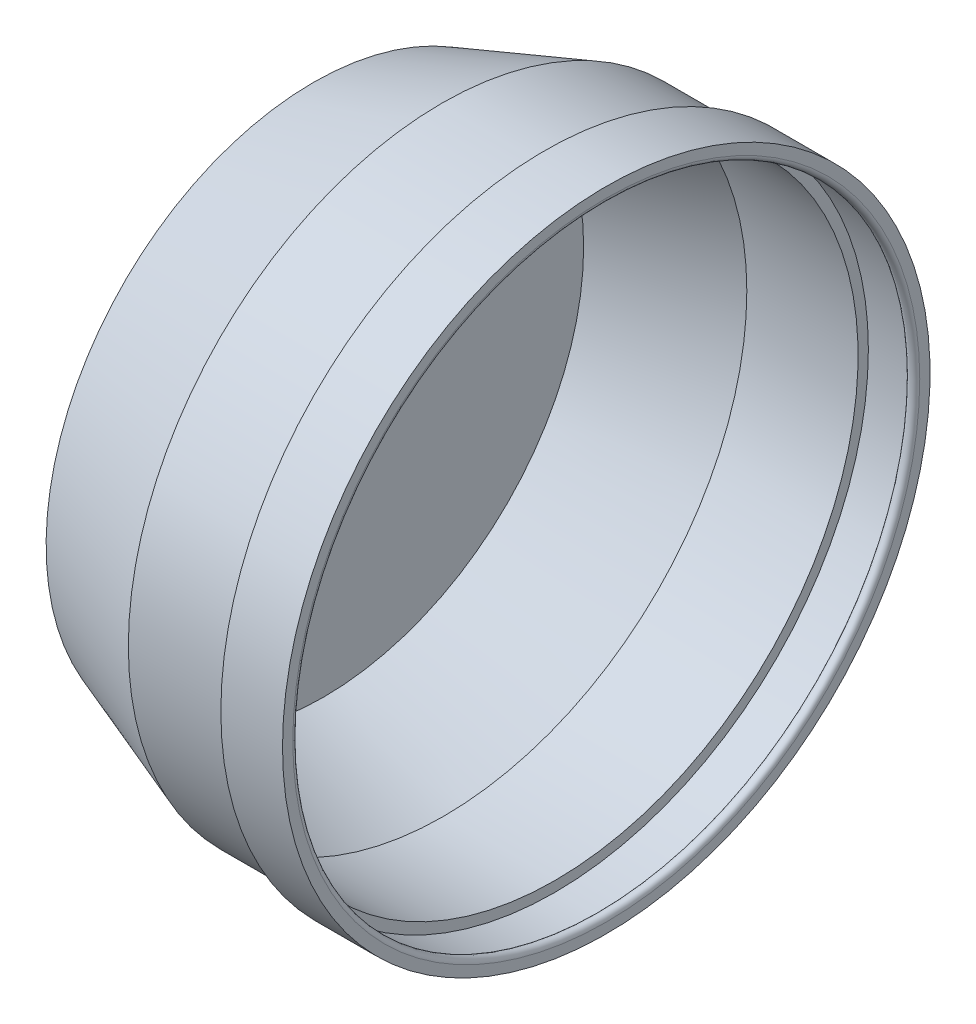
ISO-10303-21;
HEADER;
FILE_DESCRIPTION(('STEP AP214'),'2;1');
FILE_NAME('part.step','',(''),(''),'','','');
FILE_SCHEMA(('AUTOMOTIVE_DESIGN { 1 0 10303 214 1 1 1 1 }'));
ENDSEC;
DATA;
#1=APPLICATION_CONTEXT('core data for automotive mechanical design processes');
#2=APPLICATION_PROTOCOL_DEFINITION('international standard','automotive_design',2000,#1);
#3=PRODUCT_CONTEXT('',#1,'mechanical');
#4=PRODUCT('Part','Part','',(#3));
#5=PRODUCT_RELATED_PRODUCT_CATEGORY('part','',(#4));
#6=PRODUCT_DEFINITION_FORMATION('','',#4);
#7=PRODUCT_DEFINITION_CONTEXT('part definition',#1,'design');
#8=PRODUCT_DEFINITION('design','',#6,#7);
#9=PRODUCT_DEFINITION_SHAPE('','',#8);
#10=(LENGTH_UNIT() NAMED_UNIT(*) SI_UNIT(.MILLI.,.METRE.));
#11=(NAMED_UNIT(*) PLANE_ANGLE_UNIT() SI_UNIT($,.RADIAN.));
#12=(NAMED_UNIT(*) SI_UNIT($,.STERADIAN.) SOLID_ANGLE_UNIT());
#13=UNCERTAINTY_MEASURE_WITH_UNIT(LENGTH_MEASURE(1.E-05),#10,'distance_accuracy_value','');
#14=(GEOMETRIC_REPRESENTATION_CONTEXT(3) GLOBAL_UNCERTAINTY_ASSIGNED_CONTEXT((#13)) GLOBAL_UNIT_ASSIGNED_CONTEXT((#10,
#11,#12)) REPRESENTATION_CONTEXT('',''));
#15=CARTESIAN_POINT('',(0.,0.,0.));
#16=DIRECTION('',(0.,0.,1.));
#17=DIRECTION('',(1.,0.,0.));
#18=AXIS2_PLACEMENT_3D('',#15,#16,#17);
#19=CARTESIAN_POINT('',(-57.,0.,0.));
#20=DIRECTION('',(-1.,0.,0.));
#21=DIRECTION('',(0.,0.,1.));
#22=AXIS2_PLACEMENT_3D('',#19,#20,#21);
#23=PLANE('',#22);
#24=CARTESIAN_POINT('',(-57.0000000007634,0.,0.));
#25=DIRECTION('',(1.,0.,0.));
#26=DIRECTION('',(0.,1.,0.));
#27=AXIS2_PLACEMENT_3D('',#24,#25,#26);
#28=CIRCLE('',#27,52.0000000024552);
#29=CARTESIAN_POINT('',(-57.0000000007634,52.0000000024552,0.));
#30=VERTEX_POINT('',#29);
#31=EDGE_CURVE('E53',#30,#30,#28,.F.);
#32=ORIENTED_EDGE('',*,*,#31,.T.);
#33=EDGE_LOOP('',(#32));
#34=FACE_BOUND('',#33,.T.);
#35=ADVANCED_FACE('F30',(#34),#23,.T.);
#36=CARTESIAN_POINT('',(-57.,0.,0.));
#37=DIRECTION('',(1.,0.,0.));
#38=DIRECTION('',(0.,1.,0.));
#39=AXIS2_PLACEMENT_3D('',#36,#37,#38);
#40=CONICAL_SURFACE('',#39,52.00000000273,0.345555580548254);
#41=ORIENTED_EDGE('',*,*,#31,.F.);
#42=EDGE_LOOP('',(#41));
#43=FACE_BOUND('',#42,.T.);
#44=CARTESIAN_POINT('',(-32.,0.,0.));
#45=DIRECTION('',(-1.,0.,0.));
#46=DIRECTION('',(0.,0.47942553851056,0.87758256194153));
#47=AXIS2_PLACEMENT_3D('',#44,#45,#46);
#48=CIRCLE('',#47,61.0000000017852);
#49=CARTESIAN_POINT('',(-32.,29.24495785,53.53253628));
#50=VERTEX_POINT('',#49);
#51=EDGE_CURVE('E50',#50,#50,#48,.T.);
#52=ORIENTED_EDGE('',*,*,#51,.T.);
#53=EDGE_LOOP('',(#52));
#54=FACE_BOUND('',#53,.T.);
#55=ADVANCED_FACE('F96',(#43,#54),#40,.T.);
#56=CARTESIAN_POINT('',(-12.,0.,0.));
#57=DIRECTION('',(-1.,0.,0.));
#58=DIRECTION('',(0.,0.,1.));
#59=AXIS2_PLACEMENT_3D('',#56,#57,#58);
#60=CYLINDRICAL_SURFACE('',#59,61.0000000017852);
#61=ORIENTED_EDGE('',*,*,#51,.F.);
#62=EDGE_LOOP('',(#61));
#63=FACE_BOUND('',#62,.T.);
#64=CARTESIAN_POINT('',(-12.,0.,0.));
#65=DIRECTION('',(-1.,0.,0.));
#66=DIRECTION('',(0.,0.,1.));
#67=AXIS2_PLACEMENT_3D('',#64,#65,#66);
#68=CIRCLE('',#67,61.0000000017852);
#69=CARTESIAN_POINT('',(-12.,0.,61.0000000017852));
#70=VERTEX_POINT('',#69);
#71=EDGE_CURVE('E52',#70,#70,#68,.T.);
#72=ORIENTED_EDGE('',*,*,#71,.T.);
#73=EDGE_LOOP('',(#72));
#74=FACE_BOUND('',#73,.T.);
#75=ADVANCED_FACE('F89',(#63,#74),#60,.T.);
#76=CARTESIAN_POINT('',(-12.,0.,0.));
#77=DIRECTION('',(-1.,0.,0.));
#78=DIRECTION('',(0.,0.,1.));
#79=AXIS2_PLACEMENT_3D('',#76,#77,#78);
#80=PLANE('',#79);
#81=ORIENTED_EDGE('',*,*,#71,.F.);
#82=EDGE_LOOP('',(#81));
#83=FACE_BOUND('',#82,.T.);
#84=CARTESIAN_POINT('',(-12.,0.,0.));
#85=DIRECTION('',(-1.,0.,0.));
#86=DIRECTION('',(0.,0.,1.));
#87=AXIS2_PLACEMENT_3D('',#84,#85,#86);
#88=CIRCLE('',#87,62.9999999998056);
#89=CARTESIAN_POINT('',(-12.,0.,62.9999999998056));
#90=VERTEX_POINT('',#89);
#91=EDGE_CURVE('E63',#90,#90,#88,.T.);
#92=ORIENTED_EDGE('',*,*,#91,.T.);
#93=EDGE_LOOP('',(#92));
#94=FACE_BOUND('',#93,.T.);
#95=ADVANCED_FACE('F83',(#83,#94),#80,.T.);
#96=CARTESIAN_POINT('',(0.,0.,0.));
#97=DIRECTION('',(-1.,0.,0.));
#98=DIRECTION('',(0.,0.,1.));
#99=AXIS2_PLACEMENT_3D('',#96,#97,#98);
#100=CYLINDRICAL_SURFACE('',#99,62.9999999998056);
#101=ORIENTED_EDGE('',*,*,#91,.F.);
#102=EDGE_LOOP('',(#101));
#103=FACE_BOUND('',#102,.T.);
#104=CARTESIAN_POINT('',(0.,0.,0.));
#105=DIRECTION('',(-1.,0.,0.));
#106=DIRECTION('',(0.,0.,1.));
#107=AXIS2_PLACEMENT_3D('',#104,#105,#106);
#108=CIRCLE('',#107,62.9999999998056);
#109=CARTESIAN_POINT('',(0.,0.,62.9999999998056));
#110=VERTEX_POINT('',#109);
#111=EDGE_CURVE('E60',#110,#110,#108,.T.);
#112=ORIENTED_EDGE('',*,*,#111,.T.);
#113=EDGE_LOOP('',(#112));
#114=FACE_BOUND('',#113,.T.);
#115=ADVANCED_FACE('F78',(#103,#114),#100,.T.);
#116=CARTESIAN_POINT('',(0.,0.,0.));
#117=DIRECTION('',(-1.,0.,0.));
#118=DIRECTION('',(0.,0.,1.));
#119=AXIS2_PLACEMENT_3D('',#116,#117,#118);
#120=PLANE('',#119);
#121=CARTESIAN_POINT('',(2.85015067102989E-11,0.,0.));
#122=DIRECTION('',(1.,0.,0.));
#123=DIRECTION('',(0.,0.,-1.));
#124=AXIS2_PLACEMENT_3D('',#121,#122,#123);
#125=CIRCLE('',#124,61.0000000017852);
#126=CARTESIAN_POINT('',(2.85015067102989E-11,0.,-61.0000000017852));
#127=VERTEX_POINT('',#126);
#128=EDGE_CURVE('E49',#127,#127,#125,.T.);
#129=ORIENTED_EDGE('',*,*,#128,.F.);
#130=EDGE_LOOP('',(#129));
#131=FACE_BOUND('',#130,.T.);
#132=ORIENTED_EDGE('',*,*,#111,.F.);
#133=EDGE_LOOP('',(#132));
#134=FACE_BOUND('',#133,.T.);
#135=ADVANCED_FACE('F75',(#131,#134),#120,.F.);
#136=CARTESIAN_POINT('',(-0.999999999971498,0.,0.));
#137=DIRECTION('',(1.,0.,0.));
#138=DIRECTION('',(0.,0.,-1.));
#139=AXIS2_PLACEMENT_3D('',#136,#137,#138);
#140=TOROIDAL_SURFACE('',#139,61.0000000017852,1.);
#141=ORIENTED_EDGE('',*,*,#128,.T.);
#142=EDGE_LOOP('',(#141));
#143=FACE_BOUND('',#142,.T.);
#144=CARTESIAN_POINT('',(-1.9999999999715,0.,0.));
#145=DIRECTION('',(1.,0.,0.));
#146=DIRECTION('',(0.,0.,-1.));
#147=AXIS2_PLACEMENT_3D('',#144,#145,#146);
#148=CIRCLE('',#147,61.0000000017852);
#149=CARTESIAN_POINT('',(-1.9999999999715,0.,-61.0000000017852));
#150=VERTEX_POINT('',#149);
#151=EDGE_CURVE('E10',#150,#150,#148,.F.);
#152=ORIENTED_EDGE('',*,*,#151,.T.);
#153=EDGE_LOOP('',(#152));
#154=FACE_BOUND('',#153,.T.);
#155=ADVANCED_FACE('F73',(#143,#154),#140,.T.);
#156=CARTESIAN_POINT('',(-55.,0.,0.));
#157=DIRECTION('',(-1.,0.,0.));
#158=DIRECTION('',(0.,0.,1.));
#159=AXIS2_PLACEMENT_3D('',#156,#157,#158);
#160=PLANE('',#159);
#161=CARTESIAN_POINT('',(-55.,0.,0.));
#162=DIRECTION('',(1.,0.,0.));
#163=DIRECTION('',(0.,0.,-1.));
#164=AXIS2_PLACEMENT_3D('',#161,#162,#163);
#165=CIRCLE('',#164,50.5943471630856);
#166=CARTESIAN_POINT('',(-55.,0.,-50.5943471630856));
#167=VERTEX_POINT('',#166);
#168=EDGE_CURVE('E40',#167,#167,#165,.T.);
#169=ORIENTED_EDGE('',*,*,#168,.T.);
#170=EDGE_LOOP('',(#169));
#171=FACE_BOUND('',#170,.T.);
#172=ADVANCED_FACE('F111',(#171),#160,.F.);
#173=CARTESIAN_POINT('',(-55.,0.,0.));
#174=DIRECTION('',(1.,0.,0.));
#175=DIRECTION('',(0.,0.,-1.));
#176=AXIS2_PLACEMENT_3D('',#173,#174,#175);
#177=CONICAL_SURFACE('',#176,50.5943471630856,0.345555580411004);
#178=CARTESIAN_POINT('',(-31.65096433,0.,0.));
#179=DIRECTION('',(1.,0.,0.));
#180=DIRECTION('',(0.,-0.47942553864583,-0.877582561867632));
#181=AXIS2_PLACEMENT_3D('',#178,#179,#180);
#182=CIRCLE('',#181,58.9999999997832);
#183=CARTESIAN_POINT('',(-31.65096433,-28.28610678,-51.77737115));
#184=VERTEX_POINT('',#183);
#185=EDGE_CURVE('E36',#184,#184,#182,.F.);
#186=ORIENTED_EDGE('',*,*,#185,.F.);
#187=EDGE_LOOP('',(#186));
#188=FACE_BOUND('',#187,.T.);
#189=ORIENTED_EDGE('',*,*,#168,.F.);
#190=EDGE_LOOP('',(#189));
#191=FACE_BOUND('',#190,.T.);
#192=ADVANCED_FACE('F116',(#188,#191),#177,.F.);
#193=CARTESIAN_POINT('',(-10.,0.,0.));
#194=DIRECTION('',(-1.,0.,0.));
#195=DIRECTION('',(0.,-1.,0.));
#196=AXIS2_PLACEMENT_3D('',#193,#194,#195);
#197=CYLINDRICAL_SURFACE('',#196,58.9999999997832);
#198=CARTESIAN_POINT('',(-10.,0.,0.));
#199=DIRECTION('',(-1.,0.,0.));
#200=DIRECTION('',(0.,-1.,0.));
#201=AXIS2_PLACEMENT_3D('',#198,#199,#200);
#202=CIRCLE('',#201,58.9999999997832);
#203=CARTESIAN_POINT('',(-10.,-58.9999999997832,0.));
#204=VERTEX_POINT('',#203);
#205=EDGE_CURVE('E45',#204,#204,#202,.T.);
#206=ORIENTED_EDGE('',*,*,#205,.F.);
#207=EDGE_LOOP('',(#206));
#208=FACE_BOUND('',#207,.T.);
#209=ORIENTED_EDGE('',*,*,#185,.T.);
#210=EDGE_LOOP('',(#209));
#211=FACE_BOUND('',#210,.T.);
#212=ADVANCED_FACE('F122',(#208,#211),#197,.F.);
#213=CARTESIAN_POINT('',(-10.,0.,0.));
#214=DIRECTION('',(-1.,0.,0.));
#215=DIRECTION('',(0.,0.,1.));
#216=AXIS2_PLACEMENT_3D('',#213,#214,#215);
#217=PLANE('',#216);
#218=ORIENTED_EDGE('',*,*,#205,.T.);
#219=EDGE_LOOP('',(#218));
#220=FACE_BOUND('',#219,.T.);
#221=CARTESIAN_POINT('',(-10.,0.,0.));
#222=DIRECTION('',(-1.,0.,0.));
#223=DIRECTION('',(0.,0.,1.));
#224=AXIS2_PLACEMENT_3D('',#221,#222,#223);
#225=CIRCLE('',#224,61.0000000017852);
#226=CARTESIAN_POINT('',(-10.,0.,61.0000000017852));
#227=VERTEX_POINT('',#226);
#228=EDGE_CURVE('E57',#227,#227,#225,.T.);
#229=ORIENTED_EDGE('',*,*,#228,.F.);
#230=EDGE_LOOP('',(#229));
#231=FACE_BOUND('',#230,.T.);
#232=ADVANCED_FACE('F125',(#220,#231),#217,.F.);
#233=CARTESIAN_POINT('',(2.849986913E-11,0.,0.));
#234=DIRECTION('',(-1.,0.,0.));
#235=DIRECTION('',(0.,0.,1.));
#236=AXIS2_PLACEMENT_3D('',#233,#234,#235);
#237=CYLINDRICAL_SURFACE('',#236,61.0000000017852);
#238=ORIENTED_EDGE('',*,*,#151,.F.);
#239=EDGE_LOOP('',(#238));
#240=FACE_BOUND('',#239,.T.);
#241=ORIENTED_EDGE('',*,*,#228,.T.);
#242=EDGE_LOOP('',(#241));
#243=FACE_BOUND('',#242,.T.);
#244=ADVANCED_FACE('F129',(#240,#243),#237,.F.);
#245=CLOSED_SHELL('',(#35,#55,#75,#95,#115,#135,#155,#172,#192,#212,#232,#244));
#246=MANIFOLD_SOLID_BREP('B2',#245);
#247=ADVANCED_BREP_SHAPE_REPRESENTATION('',(#18,#246),#14);
#248=SHAPE_DEFINITION_REPRESENTATION(#9,#247);
ENDSEC;
END-ISO-10303-21;
